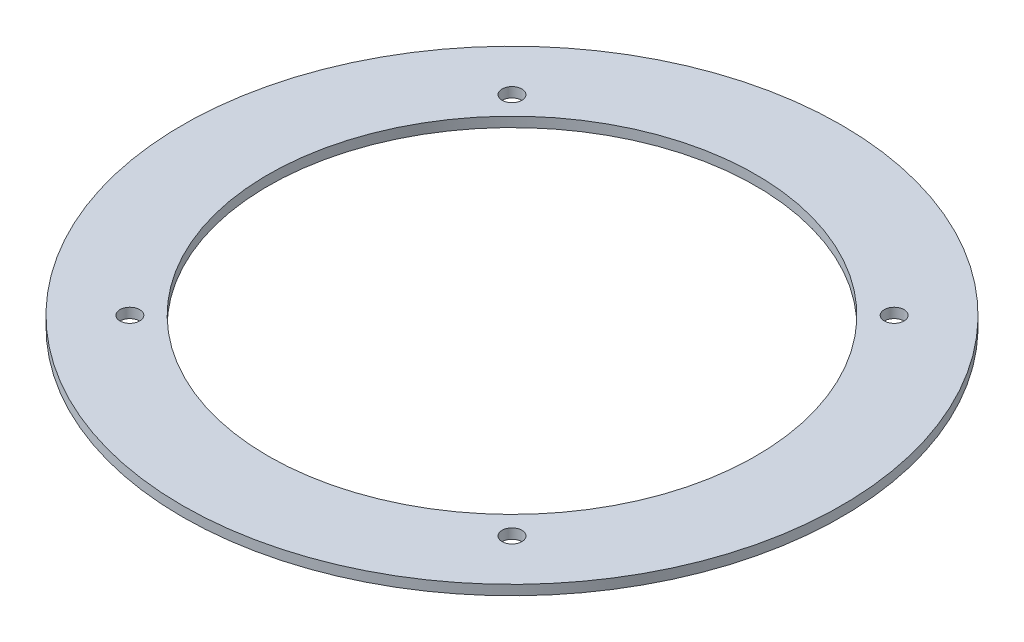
ISO-10303-21;
HEADER;
FILE_DESCRIPTION(('STEP AP214'),'2;1');
FILE_NAME('part.step','',(''),(''),'','','');
FILE_SCHEMA(('AUTOMOTIVE_DESIGN { 1 0 10303 214 1 1 1 1 }'));
ENDSEC;
DATA;
#1=APPLICATION_CONTEXT('core data for automotive mechanical design processes');
#2=APPLICATION_PROTOCOL_DEFINITION('international standard','automotive_design',2000,#1);
#3=PRODUCT_CONTEXT('',#1,'mechanical');
#4=PRODUCT('Part','Part','',(#3));
#5=PRODUCT_RELATED_PRODUCT_CATEGORY('part','',(#4));
#6=PRODUCT_DEFINITION_FORMATION('','',#4);
#7=PRODUCT_DEFINITION_CONTEXT('part definition',#1,'design');
#8=PRODUCT_DEFINITION('design','',#6,#7);
#9=PRODUCT_DEFINITION_SHAPE('','',#8);
#10=(LENGTH_UNIT() NAMED_UNIT(*) SI_UNIT(.MILLI.,.METRE.));
#11=(NAMED_UNIT(*) PLANE_ANGLE_UNIT() SI_UNIT($,.RADIAN.));
#12=(NAMED_UNIT(*) SI_UNIT($,.STERADIAN.) SOLID_ANGLE_UNIT());
#13=UNCERTAINTY_MEASURE_WITH_UNIT(LENGTH_MEASURE(1.E-05),#10,'distance_accuracy_value','');
#14=(GEOMETRIC_REPRESENTATION_CONTEXT(3) GLOBAL_UNCERTAINTY_ASSIGNED_CONTEXT((#13)) GLOBAL_UNIT_ASSIGNED_CONTEXT((#10,
#11,#12)) REPRESENTATION_CONTEXT('',''));
#15=CARTESIAN_POINT('',(0.,0.,0.));
#16=DIRECTION('',(0.,0.,1.));
#17=DIRECTION('',(1.,0.,0.));
#18=AXIS2_PLACEMENT_3D('',#15,#16,#17);
#19=CARTESIAN_POINT('',(0.,-1.5,0.));
#20=DIRECTION('',(0.,1.,0.));
#21=DIRECTION('',(0.,0.,1.));
#22=AXIS2_PLACEMENT_3D('',#19,#20,#21);
#23=CYLINDRICAL_SURFACE('',#22,50.);
#24=CARTESIAN_POINT('',(0.,-1.5,0.));
#25=DIRECTION('',(0.,1.,0.));
#26=DIRECTION('',(0.,0.,1.));
#27=AXIS2_PLACEMENT_3D('',#24,#25,#26);
#28=CIRCLE('',#27,50.);
#29=CARTESIAN_POINT('',(0.,-1.5,50.));
#30=VERTEX_POINT('',#29);
#31=EDGE_CURVE('E10',#30,#30,#28,.T.);
#32=ORIENTED_EDGE('',*,*,#31,.T.);
#33=EDGE_LOOP('',(#32));
#34=FACE_BOUND('',#33,.T.);
#35=CARTESIAN_POINT('',(0.,0.,0.));
#36=DIRECTION('',(0.,1.,0.));
#37=DIRECTION('',(0.,0.,1.));
#38=AXIS2_PLACEMENT_3D('',#35,#36,#37);
#39=CIRCLE('',#38,50.);
#40=CARTESIAN_POINT('',(0.,0.,50.));
#41=VERTEX_POINT('',#40);
#42=EDGE_CURVE('E45',#41,#41,#39,.T.);
#43=ORIENTED_EDGE('',*,*,#42,.F.);
#44=EDGE_LOOP('',(#43));
#45=FACE_BOUND('',#44,.T.);
#46=ADVANCED_FACE('F42',(#34,#45),#23,.T.);
#47=CARTESIAN_POINT('',(0.,-1.5,0.));
#48=DIRECTION('',(0.,1.,0.));
#49=DIRECTION('',(0.,0.,1.));
#50=AXIS2_PLACEMENT_3D('',#47,#48,#49);
#51=PLANE('',#50);
#52=CARTESIAN_POINT('',(-28.9913780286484,-1.5,28.9913780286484));
#53=DIRECTION('',(0.,1.,0.));
#54=DIRECTION('',(0.,0.,1.));
#55=AXIS2_PLACEMENT_3D('',#52,#53,#54);
#56=CIRCLE('',#55,1.5);
#57=CARTESIAN_POINT('',(-28.9913780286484,-1.5,30.4913780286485));
#58=VERTEX_POINT('',#57);
#59=EDGE_CURVE('E72',#58,#58,#56,.T.);
#60=ORIENTED_EDGE('',*,*,#59,.T.);
#61=EDGE_LOOP('',(#60));
#62=FACE_BOUND('',#61,.T.);
#63=CARTESIAN_POINT('',(28.9913780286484,-1.5,28.9913780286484));
#64=DIRECTION('',(0.,1.,0.));
#65=DIRECTION('',(0.,0.,1.));
#66=AXIS2_PLACEMENT_3D('',#63,#64,#65);
#67=CIRCLE('',#66,1.5);
#68=CARTESIAN_POINT('',(28.9913780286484,-1.5,30.4913780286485));
#69=VERTEX_POINT('',#68);
#70=EDGE_CURVE('E80',#69,#69,#67,.T.);
#71=ORIENTED_EDGE('',*,*,#70,.T.);
#72=EDGE_LOOP('',(#71));
#73=FACE_BOUND('',#72,.T.);
#74=CARTESIAN_POINT('',(28.9913780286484,-1.5,-28.9913780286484));
#75=DIRECTION('',(0.,1.,0.));
#76=DIRECTION('',(0.,0.,1.));
#77=AXIS2_PLACEMENT_3D('',#74,#75,#76);
#78=CIRCLE('',#77,1.5);
#79=CARTESIAN_POINT('',(28.9913780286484,-1.5,-27.4913780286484));
#80=VERTEX_POINT('',#79);
#81=EDGE_CURVE('E88',#80,#80,#78,.T.);
#82=ORIENTED_EDGE('',*,*,#81,.T.);
#83=EDGE_LOOP('',(#82));
#84=FACE_BOUND('',#83,.T.);
#85=CARTESIAN_POINT('',(-28.9913780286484,-1.5,-28.9913780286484));
#86=DIRECTION('',(0.,1.,0.));
#87=DIRECTION('',(0.,0.,1.));
#88=AXIS2_PLACEMENT_3D('',#85,#86,#87);
#89=CIRCLE('',#88,1.5);
#90=CARTESIAN_POINT('',(-28.9913780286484,-1.5,-27.4913780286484));
#91=VERTEX_POINT('',#90);
#92=EDGE_CURVE('E60',#91,#91,#89,.T.);
#93=ORIENTED_EDGE('',*,*,#92,.T.);
#94=EDGE_LOOP('',(#93));
#95=FACE_BOUND('',#94,.T.);
#96=CARTESIAN_POINT('',(0.,-1.5,0.));
#97=DIRECTION('',(0.,1.,0.));
#98=DIRECTION('',(0.,0.,1.));
#99=AXIS2_PLACEMENT_3D('',#96,#97,#98);
#100=CIRCLE('',#99,37.);
#101=CARTESIAN_POINT('',(0.,-1.5,37.));
#102=VERTEX_POINT('',#101);
#103=EDGE_CURVE('E54',#102,#102,#100,.T.);
#104=ORIENTED_EDGE('',*,*,#103,.T.);
#105=EDGE_LOOP('',(#104));
#106=FACE_BOUND('',#105,.T.);
#107=ORIENTED_EDGE('',*,*,#31,.F.);
#108=EDGE_LOOP('',(#107));
#109=FACE_BOUND('',#108,.T.);
#110=ADVANCED_FACE('F102',(#62,#73,#84,#95,#106,#109),#51,.F.);
#111=CARTESIAN_POINT('',(0.,0.,0.));
#112=DIRECTION('',(0.,1.,0.));
#113=DIRECTION('',(0.,0.,1.));
#114=AXIS2_PLACEMENT_3D('',#111,#112,#113);
#115=PLANE('',#114);
#116=CARTESIAN_POINT('',(-28.9913780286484,0.,28.9913780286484));
#117=DIRECTION('',(0.,1.,0.));
#118=DIRECTION('',(0.,0.,1.));
#119=AXIS2_PLACEMENT_3D('',#116,#117,#118);
#120=CIRCLE('',#119,1.5);
#121=CARTESIAN_POINT('',(-28.9913780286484,0.,30.4913780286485));
#122=VERTEX_POINT('',#121);
#123=EDGE_CURVE('E76',#122,#122,#120,.T.);
#124=ORIENTED_EDGE('',*,*,#123,.F.);
#125=EDGE_LOOP('',(#124));
#126=FACE_BOUND('',#125,.T.);
#127=CARTESIAN_POINT('',(28.9913780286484,0.,28.9913780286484));
#128=DIRECTION('',(0.,1.,0.));
#129=DIRECTION('',(0.,0.,1.));
#130=AXIS2_PLACEMENT_3D('',#127,#128,#129);
#131=CIRCLE('',#130,1.5);
#132=CARTESIAN_POINT('',(28.9913780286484,0.,30.4913780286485));
#133=VERTEX_POINT('',#132);
#134=EDGE_CURVE('E84',#133,#133,#131,.T.);
#135=ORIENTED_EDGE('',*,*,#134,.F.);
#136=EDGE_LOOP('',(#135));
#137=FACE_BOUND('',#136,.T.);
#138=CARTESIAN_POINT('',(28.9913780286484,0.,-28.9913780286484));
#139=DIRECTION('',(0.,1.,0.));
#140=DIRECTION('',(0.,0.,1.));
#141=AXIS2_PLACEMENT_3D('',#138,#139,#140);
#142=CIRCLE('',#141,1.5);
#143=CARTESIAN_POINT('',(28.9913780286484,0.,-27.4913780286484));
#144=VERTEX_POINT('',#143);
#145=EDGE_CURVE('E68',#144,#144,#142,.T.);
#146=ORIENTED_EDGE('',*,*,#145,.F.);
#147=EDGE_LOOP('',(#146));
#148=FACE_BOUND('',#147,.T.);
#149=CARTESIAN_POINT('',(-28.9913780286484,0.,-28.9913780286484));
#150=DIRECTION('',(0.,1.,0.));
#151=DIRECTION('',(0.,0.,1.));
#152=AXIS2_PLACEMENT_3D('',#149,#150,#151);
#153=CIRCLE('',#152,1.5);
#154=CARTESIAN_POINT('',(-28.9913780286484,0.,-27.4913780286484));
#155=VERTEX_POINT('',#154);
#156=EDGE_CURVE('E64',#155,#155,#153,.T.);
#157=ORIENTED_EDGE('',*,*,#156,.F.);
#158=EDGE_LOOP('',(#157));
#159=FACE_BOUND('',#158,.T.);
#160=CARTESIAN_POINT('',(0.,0.,0.));
#161=DIRECTION('',(0.,1.,0.));
#162=DIRECTION('',(0.,0.,1.));
#163=AXIS2_PLACEMENT_3D('',#160,#161,#162);
#164=CIRCLE('',#163,37.);
#165=CARTESIAN_POINT('',(0.,0.,37.));
#166=VERTEX_POINT('',#165);
#167=EDGE_CURVE('E56',#166,#166,#164,.T.);
#168=ORIENTED_EDGE('',*,*,#167,.F.);
#169=EDGE_LOOP('',(#168));
#170=FACE_BOUND('',#169,.T.);
#171=ORIENTED_EDGE('',*,*,#42,.T.);
#172=EDGE_LOOP('',(#171));
#173=FACE_BOUND('',#172,.T.);
#174=ADVANCED_FACE('F98',(#126,#137,#148,#159,#170,#173),#115,.T.);
#175=CARTESIAN_POINT('',(0.,-1.5,0.));
#176=DIRECTION('',(0.,1.,0.));
#177=DIRECTION('',(0.,0.,1.));
#178=AXIS2_PLACEMENT_3D('',#175,#176,#177);
#179=CYLINDRICAL_SURFACE('',#178,37.);
#180=ORIENTED_EDGE('',*,*,#103,.F.);
#181=EDGE_LOOP('',(#180));
#182=FACE_BOUND('',#181,.T.);
#183=ORIENTED_EDGE('',*,*,#167,.T.);
#184=EDGE_LOOP('',(#183));
#185=FACE_BOUND('',#184,.T.);
#186=ADVANCED_FACE('F101',(#182,#185),#179,.F.);
#187=CARTESIAN_POINT('',(-28.9913780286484,-1.5,-28.9913780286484));
#188=DIRECTION('',(0.,1.,0.));
#189=DIRECTION('',(0.,0.,1.));
#190=AXIS2_PLACEMENT_3D('',#187,#188,#189);
#191=CYLINDRICAL_SURFACE('',#190,1.5);
#192=ORIENTED_EDGE('',*,*,#92,.F.);
#193=EDGE_LOOP('',(#192));
#194=FACE_BOUND('',#193,.T.);
#195=ORIENTED_EDGE('',*,*,#156,.T.);
#196=EDGE_LOOP('',(#195));
#197=FACE_BOUND('',#196,.T.);
#198=ADVANCED_FACE('F122',(#194,#197),#191,.F.);
#199=CARTESIAN_POINT('',(28.9913780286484,-1.5,-28.9913780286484));
#200=DIRECTION('',(0.,1.,0.));
#201=DIRECTION('',(0.,0.,1.));
#202=AXIS2_PLACEMENT_3D('',#199,#200,#201);
#203=CYLINDRICAL_SURFACE('',#202,1.5);
#204=ORIENTED_EDGE('',*,*,#81,.F.);
#205=EDGE_LOOP('',(#204));
#206=FACE_BOUND('',#205,.T.);
#207=ORIENTED_EDGE('',*,*,#145,.T.);
#208=EDGE_LOOP('',(#207));
#209=FACE_BOUND('',#208,.T.);
#210=ADVANCED_FACE('F96',(#206,#209),#203,.F.);
#211=CARTESIAN_POINT('',(28.9913780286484,-1.5,28.9913780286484));
#212=DIRECTION('',(0.,1.,0.));
#213=DIRECTION('',(0.,0.,1.));
#214=AXIS2_PLACEMENT_3D('',#211,#212,#213);
#215=CYLINDRICAL_SURFACE('',#214,1.5);
#216=ORIENTED_EDGE('',*,*,#70,.F.);
#217=EDGE_LOOP('',(#216));
#218=FACE_BOUND('',#217,.T.);
#219=ORIENTED_EDGE('',*,*,#134,.T.);
#220=EDGE_LOOP('',(#219));
#221=FACE_BOUND('',#220,.T.);
#222=ADVANCED_FACE('F130',(#218,#221),#215,.F.);
#223=CARTESIAN_POINT('',(-28.9913780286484,-1.5,28.9913780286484));
#224=DIRECTION('',(0.,1.,0.));
#225=DIRECTION('',(0.,0.,1.));
#226=AXIS2_PLACEMENT_3D('',#223,#224,#225);
#227=CYLINDRICAL_SURFACE('',#226,1.5);
#228=ORIENTED_EDGE('',*,*,#59,.F.);
#229=EDGE_LOOP('',(#228));
#230=FACE_BOUND('',#229,.T.);
#231=ORIENTED_EDGE('',*,*,#123,.T.);
#232=EDGE_LOOP('',(#231));
#233=FACE_BOUND('',#232,.T.);
#234=ADVANCED_FACE('F127',(#230,#233),#227,.F.);
#235=CLOSED_SHELL('',(#46,#110,#174,#186,#198,#210,#222,#234));
#236=MANIFOLD_SOLID_BREP('B2',#235);
#237=ADVANCED_BREP_SHAPE_REPRESENTATION('',(#18,#236),#14);
#238=SHAPE_DEFINITION_REPRESENTATION(#9,#237);
ENDSEC;
END-ISO-10303-21;
